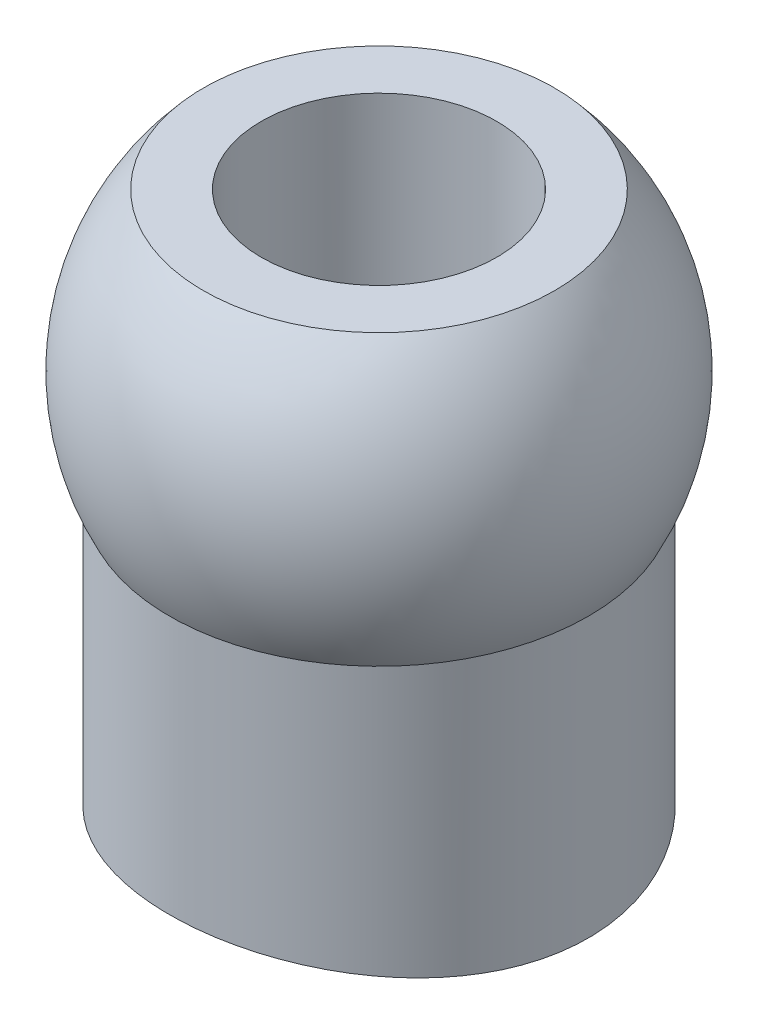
ISO-10303-21;
HEADER;
FILE_DESCRIPTION(('STEP AP214'),'2;1');
FILE_NAME('part.step','',(''),(''),'','','');
FILE_SCHEMA(('AUTOMOTIVE_DESIGN { 1 0 10303 214 1 1 1 1 }'));
ENDSEC;
DATA;
#1=APPLICATION_CONTEXT('core data for automotive mechanical design processes');
#2=APPLICATION_PROTOCOL_DEFINITION('international standard','automotive_design',2000,#1);
#3=PRODUCT_CONTEXT('',#1,'mechanical');
#4=PRODUCT('Part','Part','',(#3));
#5=PRODUCT_RELATED_PRODUCT_CATEGORY('part','',(#4));
#6=PRODUCT_DEFINITION_FORMATION('','',#4);
#7=PRODUCT_DEFINITION_CONTEXT('part definition',#1,'design');
#8=PRODUCT_DEFINITION('design','',#6,#7);
#9=PRODUCT_DEFINITION_SHAPE('','',#8);
#10=(LENGTH_UNIT() NAMED_UNIT(*) SI_UNIT(.MILLI.,.METRE.));
#11=(NAMED_UNIT(*) PLANE_ANGLE_UNIT() SI_UNIT($,.RADIAN.));
#12=(NAMED_UNIT(*) SI_UNIT($,.STERADIAN.) SOLID_ANGLE_UNIT());
#13=UNCERTAINTY_MEASURE_WITH_UNIT(LENGTH_MEASURE(1.E-05),#10,'distance_accuracy_value','');
#14=(GEOMETRIC_REPRESENTATION_CONTEXT(3) GLOBAL_UNCERTAINTY_ASSIGNED_CONTEXT((#13)) GLOBAL_UNIT_ASSIGNED_CONTEXT((#10,
#11,#12)) REPRESENTATION_CONTEXT('',''));
#15=CARTESIAN_POINT('',(0.,0.,0.));
#16=DIRECTION('',(0.,0.,1.));
#17=DIRECTION('',(1.,0.,0.));
#18=AXIS2_PLACEMENT_3D('',#15,#16,#17);
#19=CARTESIAN_POINT('',(0.,0.,0.));
#20=DIRECTION('',(0.,1.,0.));
#21=DIRECTION('',(1.,0.,0.));
#22=AXIS2_PLACEMENT_3D('',#19,#20,#21);
#23=SPHERICAL_SURFACE('',#22,4.5);
#24=CARTESIAN_POINT('',(0.,3.,0.));
#25=DIRECTION('',(0.,1.,0.));
#26=DIRECTION('',(-1.,0.,0.));
#27=AXIS2_PLACEMENT_3D('',#24,#25,#26);
#28=CIRCLE('',#27,3.35410196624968);
#29=CARTESIAN_POINT('',(3.35410196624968,3.,0.));
#30=VERTEX_POINT('',#29);
#31=EDGE_CURVE('E39',#30,#30,#28,.T.);
#32=CARTESIAN_POINT('',(0.,-2.06155281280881,0.));
#33=DIRECTION('',(0.,1.,0.));
#34=DIRECTION('',(-1.,0.,0.));
#35=AXIS2_PLACEMENT_3D('',#32,#33,#34);
#36=CIRCLE('',#35,4.);
#37=CARTESIAN_POINT('',(4.00000000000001,-2.06155281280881,0.));
#38=VERTEX_POINT('',#37);
#39=EDGE_CURVE('E43',#38,#38,#36,.T.);
#40=CARTESIAN_POINT('',(3.35410196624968,3.,0.));
#41=CARTESIAN_POINT('',(3.39177769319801,2.95787807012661,0.));
#42=CARTESIAN_POINT('',(3.42865911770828,2.91504574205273,0.));
#43=CARTESIAN_POINT('',(3.50078285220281,2.82802260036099,0.));
#44=CARTESIAN_POINT('',(3.53602516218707,2.78383178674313,0.));
#45=CARTESIAN_POINT('',(3.60482015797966,2.69415398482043,0.));
#46=CARTESIAN_POINT('',(3.638372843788,2.6486669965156,0.));
#47=CARTESIAN_POINT('',(3.70374110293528,2.55646151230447,0.));
#48=CARTESIAN_POINT('',(3.73555667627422,2.50974301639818,0.));
#49=CARTESIAN_POINT('',(3.79740552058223,2.41514079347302,0.));
#50=CARTESIAN_POINT('',(3.8274387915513,2.36725706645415,0.));
#51=CARTESIAN_POINT('',(3.88568041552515,2.27039234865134,0.));
#52=CARTESIAN_POINT('',(3.91388876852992,2.22141135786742,0.));
#53=CARTESIAN_POINT('',(3.96844051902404,2.12242162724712,0.));
#54=CARTESIAN_POINT('',(3.99478391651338,2.07241288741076,0.));
#55=CARTESIAN_POINT('',(4.0455683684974,1.97143863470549,0.));
#56=CARTESIAN_POINT('',(4.07000942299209,1.92047312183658,0.));
#57=CARTESIAN_POINT('',(4.11695450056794,1.81765765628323,0.));
#58=CARTESIAN_POINT('',(4.13945852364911,1.7658077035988,0.));
#59=CARTESIAN_POINT('',(4.18249759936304,1.66129694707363,0.));
#60=CARTESIAN_POINT('',(4.20303265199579,1.6086361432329,0.));
#61=CARTESIAN_POINT('',(4.24210464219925,1.50257842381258,0.));
#62=CARTESIAN_POINT('',(4.26064157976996,1.449181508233,0.));
#63=CARTESIAN_POINT('',(4.29569103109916,1.34172734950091,0.));
#64=CARTESIAN_POINT('',(4.31220354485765,1.2876701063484,0.));
#65=CARTESIAN_POINT('',(4.3431807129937,1.17897201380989,0.));
#66=CARTESIAN_POINT('',(4.35764536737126,1.12433116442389,0.));
#67=CARTESIAN_POINT('',(4.38450628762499,1.01454340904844,0.));
#68=CARTESIAN_POINT('',(4.39690255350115,0.959396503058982,0.));
#69=CARTESIAN_POINT('',(4.41960910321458,0.84867490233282,0.));
#70=CARTESIAN_POINT('',(4.42991938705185,0.793100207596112,0.));
#71=CARTESIAN_POINT('',(4.44843933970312,0.681601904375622,0.));
#72=CARTESIAN_POINT('',(4.45664900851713,0.62567829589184,0.));
#73=CARTESIAN_POINT('',(4.47095607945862,0.513561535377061,0.));
#74=CARTESIAN_POINT('',(4.4770534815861,0.457368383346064,0.));
#75=CARTESIAN_POINT('',(4.48712736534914,0.344792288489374,0.));
#76=CARTESIAN_POINT('',(4.49110384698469,0.288409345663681,0.));
#77=CARTESIAN_POINT('',(4.49693024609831,0.175533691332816,0.));
#78=CARTESIAN_POINT('',(4.49878016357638,0.119040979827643,0.));
#79=CARTESIAN_POINT('',(4.50035080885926,0.00602596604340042,0.));
#80=CARTESIAN_POINT('',(4.50007153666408,-0.0504963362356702,0.));
#81=CARTESIAN_POINT('',(4.49738419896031,-0.163490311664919,0.));
#82=CARTESIAN_POINT('',(4.49497613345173,-0.219961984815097,0.));
#83=CARTESIAN_POINT('',(4.48803462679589,-0.332774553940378,0.));
#84=CARTESIAN_POINT('',(4.48350118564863,-0.389115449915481,0.));
#85=CARTESIAN_POINT('',(4.47231536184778,-0.501586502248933,0.));
#86=CARTESIAN_POINT('',(4.4656629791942,-0.557716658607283,0.));
#87=CARTESIAN_POINT('',(4.45024871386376,-0.669686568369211,0.));
#88=CARTESIAN_POINT('',(4.44148683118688,-0.72552632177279,0.));
#89=CARTESIAN_POINT('',(4.42186600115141,-0.836836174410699,0.));
#90=CARTESIAN_POINT('',(4.41100705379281,-0.892306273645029,0.));
#91=CARTESIAN_POINT('',(4.38720750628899,-1.00279809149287,0.));
#92=CARTESIAN_POINT('',(4.37426690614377,-1.05781981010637,0.));
#93=CARTESIAN_POINT('',(4.34632241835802,-1.16733677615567,0.));
#94=CARTESIAN_POINT('',(4.33131853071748,-1.22183202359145,0.));
#95=CARTESIAN_POINT('',(4.29926876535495,-1.33021870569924,0.));
#96=CARTESIAN_POINT('',(4.28222288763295,-1.38411014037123,0.));
#97=CARTESIAN_POINT('',(4.24611332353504,-1.49121270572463,0.));
#98=CARTESIAN_POINT('',(4.22704963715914,-1.54442383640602,0.));
#99=CARTESIAN_POINT('',(4.18693155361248,-1.65009029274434,0.));
#100=CARTESIAN_POINT('',(4.16587715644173,-1.70254561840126,0.));
#101=CARTESIAN_POINT('',(4.12180737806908,-1.80662594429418,0.));
#102=CARTESIAN_POINT('',(4.09879199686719,-1.85825094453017,0.));
#103=CARTESIAN_POINT('',(4.05083349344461,-1.96059762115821,0.));
#104=CARTESIAN_POINT('',(4.02589037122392,-2.01131929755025,0.));
#105=CARTESIAN_POINT('',(4.00000000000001,-2.06155281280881,0.));
#106=B_SPLINE_CURVE_WITH_KNOTS('',3,(#40,#41,#42,#43,#44,#45,#46,#47,#48,#49,#50,#51,#52,#53,
#54,#55,#56,#57,#58,#59,#60,#61,#62,#63,#64,#65,#66,#67,#68,#69,#70,#71,#72,#73,#74,#75,#76,#77,
#78,#79,#80,#81,#82,#83,#84,#85,#86,#87,#88,#89,#90,#91,#92,#93,#94,#95,#96,#97,#98,#99,#100,
#101,#102,#103,#104,#105),.UNSPECIFIED.,.F.,.F.,(4,2,2,2,2,2,2,2,2,2,2,2,2,2,2,2,2,2,2,2,2,2,2,
2,2,2,2,2,2,2,2,2,4),(0.,0.169528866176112,0.339057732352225,0.508586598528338,0.67811546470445,
0.847644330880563,1.01717319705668,1.18670206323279,1.3562309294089,1.52575979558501,
1.69528866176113,1.86481752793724,2.03434639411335,2.20387526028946,2.37340412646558,
2.54293299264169,2.7124618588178,2.88199072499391,3.05151959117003,3.22104845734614,
3.39057732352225,3.56010618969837,3.72963505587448,3.89916392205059,4.0686927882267,
4.23822165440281,4.40775052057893,4.57727938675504,4.74680825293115,4.91633711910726,
5.08586598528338,5.25539485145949,5.4249237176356),.UNSPECIFIED.);
#107=EDGE_CURVE('BSEAM28',#30,#38,#106,.T.);
#108=ORIENTED_EDGE('',*,*,#31,.F.);
#109=ORIENTED_EDGE('',*,*,#39,.T.);
#110=ORIENTED_EDGE('',*,*,#107,.T.);
#111=ORIENTED_EDGE('',*,*,#107,.F.);
#112=EDGE_LOOP('',(#108,#110,#109,#111));
#113=FACE_BOUND('',#112,.T.);
#114=ADVANCED_FACE('F28',(#113),#23,.T.);
#115=CARTESIAN_POINT('',(0.,3.,0.));
#116=DIRECTION('',(0.,-1.,0.));
#117=DIRECTION('',(1.,0.,0.));
#118=AXIS2_PLACEMENT_3D('',#115,#116,#117);
#119=PLANE('',#118);
#120=CARTESIAN_POINT('',(0.,3.,0.));
#121=DIRECTION('',(0.,1.,0.));
#122=DIRECTION('',(0.,0.,1.));
#123=AXIS2_PLACEMENT_3D('',#120,#121,#122);
#124=CIRCLE('',#123,2.24999999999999);
#125=CARTESIAN_POINT('',(0.,3.,2.24999999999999));
#126=VERTEX_POINT('',#125);
#127=EDGE_CURVE('E77',#126,#126,#124,.T.);
#128=ORIENTED_EDGE('',*,*,#127,.F.);
#129=EDGE_LOOP('',(#128));
#130=FACE_BOUND('',#129,.T.);
#131=ORIENTED_EDGE('',*,*,#31,.T.);
#132=EDGE_LOOP('',(#131));
#133=FACE_BOUND('',#132,.T.);
#134=ADVANCED_FACE('F65',(#130,#133),#119,.F.);
#135=CARTESIAN_POINT('',(0.,52.8708930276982,0.));
#136=DIRECTION('',(0.,1.,0.));
#137=DIRECTION('',(-1.,0.,0.));
#138=AXIS2_PLACEMENT_3D('',#135,#136,#137);
#139=CYLINDRICAL_SURFACE('',#138,4.);
#140=ORIENTED_EDGE('',*,*,#39,.F.);
#141=EDGE_LOOP('',(#140));
#142=FACE_BOUND('',#141,.T.);
#143=CARTESIAN_POINT('',(-3.99999999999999,-7.38447187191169,0.));
#144=CARTESIAN_POINT('',(-3.99999153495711,-7.38446753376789,0.222484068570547));
#145=CARTESIAN_POINT('',(-3.98137482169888,-7.38083115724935,0.445077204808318));
#146=CARTESIAN_POINT('',(-3.90745280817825,-7.36669741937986,0.883982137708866));
#147=CARTESIAN_POINT('',(-3.85211679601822,-7.35619431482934,1.10028851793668));
#148=CARTESIAN_POINT('',(-3.70652120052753,-7.32955884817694,1.52020603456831));
#149=CARTESIAN_POINT('',(-3.61629466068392,-7.31343181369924,1.72382897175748));
#150=CARTESIAN_POINT('',(-3.40356743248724,-7.27737191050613,2.11303644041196));
#151=CARTESIAN_POINT('',(-3.28106909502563,-7.2574393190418,2.29862228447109));
#152=CARTESIAN_POINT('',(-3.00559908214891,-7.21572833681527,2.64888311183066));
#153=CARTESIAN_POINT('',(-2.85229293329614,-7.19393134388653,2.81329286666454));
#154=CARTESIAN_POINT('',(-2.5202819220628,-7.15111169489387,3.11422258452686));
#155=CARTESIAN_POINT('',(-2.34157536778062,-7.13008909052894,3.25074068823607));
#156=CARTESIAN_POINT('',(-1.96209093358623,-7.09098730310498,3.49303120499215));
#157=CARTESIAN_POINT('',(-1.76115035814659,-7.07293259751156,3.59855308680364));
#158=CARTESIAN_POINT('',(-1.3439914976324,-7.04200927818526,3.77424109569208));
#159=CARTESIAN_POINT('',(-1.12777451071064,-7.02914022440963,3.84441022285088));
#160=CARTESIAN_POINT('',(-0.688949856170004,-7.01016959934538,3.94657944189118));
#161=CARTESIAN_POINT('',(-0.466449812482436,-7.00398878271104,3.97902682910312));
#162=CARTESIAN_POINT('',(-0.0190839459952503,-6.99881777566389,4.00622563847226));
#163=CARTESIAN_POINT('',(0.205781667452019,-6.99982695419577,4.00098036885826));
#164=CARTESIAN_POINT('',(0.648426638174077,-7.00886042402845,3.95328492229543));
#165=CARTESIAN_POINT('',(0.866260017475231,-7.01679389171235,3.91131641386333));
#166=CARTESIAN_POINT('',(1.29173491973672,-7.03868253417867,3.79212813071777));
#167=CARTESIAN_POINT('',(1.49937606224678,-7.05263793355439,3.71490704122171));
#168=CARTESIAN_POINT('',(1.89996408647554,-7.08515371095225,3.5269496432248));
#169=CARTESIAN_POINT('',(2.09281882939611,-7.10374030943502,3.41602168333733));
#170=CARTESIAN_POINT('',(2.45735639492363,-7.14346450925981,3.16394073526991));
#171=CARTESIAN_POINT('',(2.62903699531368,-7.16460237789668,3.02278457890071));
#172=CARTESIAN_POINT('',(2.9492078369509,-7.20748399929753,2.71160263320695));
#173=CARTESIAN_POINT('',(3.09728818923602,-7.22923204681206,2.54115541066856));
#174=CARTESIAN_POINT('',(3.36282428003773,-7.27056377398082,2.17763117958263));
#175=CARTESIAN_POINT('',(3.48027954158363,-7.29014741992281,1.98455381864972));
#176=CARTESIAN_POINT('',(3.68135386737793,-7.32493978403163,1.5806961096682));
#177=CARTESIAN_POINT('',(3.76491178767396,-7.34014058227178,1.36988459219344));
#178=CARTESIAN_POINT('',(3.89530564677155,-7.36432613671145,0.936859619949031));
#179=CARTESIAN_POINT('',(3.94214589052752,-7.37331162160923,0.714647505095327));
#180=CARTESIAN_POINT('',(3.99717303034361,-7.3839045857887,0.268829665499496));
#181=CARTESIAN_POINT('',(4.0059495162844,-7.38562459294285,0.0452993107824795));
#182=CARTESIAN_POINT('',(3.98618188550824,-7.38179319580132,-0.400032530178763));
#183=CARTESIAN_POINT('',(3.95763967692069,-7.37624216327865,-0.621834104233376));
#184=CARTESIAN_POINT('',(3.86455151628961,-7.35859909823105,-1.05546384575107));
#185=CARTESIAN_POINT('',(3.80031602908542,-7.34656349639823,-1.2673611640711));
#186=CARTESIAN_POINT('',(3.63799472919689,-7.31735622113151,-1.67738552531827));
#187=CARTESIAN_POINT('',(3.53990635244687,-7.30018415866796,-1.8755115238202));
#188=CARTESIAN_POINT('',(3.31131186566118,-7.26238337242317,-2.25496251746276));
#189=CARTESIAN_POINT('',(3.18043412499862,-7.24171597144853,-2.436059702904));
#190=CARTESIAN_POINT('',(2.89047583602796,-7.19936137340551,-2.77393571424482));
#191=CARTESIAN_POINT('',(2.73139266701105,-7.17767408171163,-2.93071227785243));
#192=CARTESIAN_POINT('',(2.38690287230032,-7.1353608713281,-3.21770703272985));
#193=CARTESIAN_POINT('',(2.20116281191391,-7.11475376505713,-3.34752820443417));
#194=CARTESIAN_POINT('',(1.81016635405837,-7.07724175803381,-3.57412176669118));
#195=CARTESIAN_POINT('',(1.60491072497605,-7.06033671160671,-3.67089545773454));
#196=CARTESIAN_POINT('',(1.18179412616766,-7.03221433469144,-3.82805630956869));
#197=CARTESIAN_POINT('',(0.964006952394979,-7.02096687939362,-3.88863652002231));
#198=CARTESIAN_POINT('',(0.521114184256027,-7.00529829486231,-3.9723058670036));
#199=CARTESIAN_POINT('',(0.296009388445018,-7.00087642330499,-3.99539908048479));
#200=CARTESIAN_POINT('',(-0.151324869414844,-6.99937264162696,-4.00329324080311));
#201=CARTESIAN_POINT('',(-0.373543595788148,-7.00217591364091,-3.98869318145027));
#202=CARTESIAN_POINT('',(-0.812299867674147,-7.01456819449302,-3.92292961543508));
#203=CARTESIAN_POINT('',(-1.02883747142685,-7.02415713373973,-3.87176648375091));
#204=CARTESIAN_POINT('',(-1.4497549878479,-7.04904261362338,-3.73458478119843));
#205=CARTESIAN_POINT('',(-1.65415698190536,-7.06432839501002,-3.64863188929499));
#206=CARTESIAN_POINT('',(-2.04572631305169,-7.09895491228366,-3.44438323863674));
#207=CARTESIAN_POINT('',(-2.23289244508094,-7.11829593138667,-3.32608522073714));
#208=CARTESIAN_POINT('',(-2.58765662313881,-7.15926029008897,-3.05845213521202));
#209=CARTESIAN_POINT('',(-2.75492557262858,-7.18091306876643,-2.90868528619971));
#210=CARTESIAN_POINT('',(-3.06216464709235,-7.22387733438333,-2.5832598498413));
#211=CARTESIAN_POINT('',(-3.202128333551,-7.24518873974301,-2.40759517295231));
#212=CARTESIAN_POINT('',(-3.45204959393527,-7.2852812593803,-2.03334176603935));
#213=CARTESIAN_POINT('',(-3.56170623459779,-7.30403612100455,-1.83454916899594));
#214=CARTESIAN_POINT('',(-3.74588992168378,-7.3365751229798,-1.42106729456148));
#215=CARTESIAN_POINT('',(-3.82044982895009,-7.3503639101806,-1.20639310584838));
#216=CARTESIAN_POINT('',(-3.91733139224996,-7.368562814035,-0.825932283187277));
#217=CARTESIAN_POINT('',(-3.94827845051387,-7.37449292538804,-0.662360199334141));
#218=CARTESIAN_POINT('',(-3.98961562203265,-7.38244901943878,-0.332545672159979));
#219=CARTESIAN_POINT('',(-4.00000632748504,-7.38447511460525,-0.16630330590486));
#220=CARTESIAN_POINT('',(-3.99999999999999,-7.38447187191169,0.));
#221=B_SPLINE_CURVE_WITH_KNOTS('',3,(#143,#144,#145,#146,#147,#148,#149,#150,#151,#152,#153,
#154,#155,#156,#157,#158,#159,#160,#161,#162,#163,#164,#165,#166,#167,#168,#169,#170,#171,#172,
#173,#174,#175,#176,#177,#178,#179,#180,#181,#182,#183,#184,#185,#186,#187,#188,#189,#190,#191,
#192,#193,#194,#195,#196,#197,#198,#199,#200,#201,#202,#203,#204,#205,#206,#207,#208,#209,#210,
#211,#212,#213,#214,#215,#216,#217,#218,#219,#220),.UNSPECIFIED.,.T.,.F.,(4,2,2,2,2,2,2,2,2,2,2,
2,2,2,2,2,2,2,2,2,2,2,2,2,2,2,2,2,2,2,2,2,2,2,2,2,2,2,4),(0.,0.666843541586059,1.33424553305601,
2.00101699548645,2.66773989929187,3.34213567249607,4.01657638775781,4.69632714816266,
5.3760202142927,6.047568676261,6.71905819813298,7.38187017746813,8.04470687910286,
8.71138520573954,9.37813344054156,10.0554308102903,10.7327387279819,11.4112629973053,
12.0897077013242,12.7576052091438,13.4254685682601,14.0876116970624,14.7498049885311,
15.4198728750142,16.090003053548,16.769395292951,17.4487607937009,18.1244695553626,
18.8001048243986,19.4650697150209,20.1300277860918,20.7937363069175,21.457491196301,
22.1310297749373,22.8047269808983,23.4848911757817,24.1644172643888,24.6628865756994,
25.161341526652),.UNSPECIFIED.);
#222=CARTESIAN_POINT('',(-3.99999999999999,-7.38447187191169,0.));
#223=VERTEX_POINT('',#222);
#224=EDGE_CURVE('E10',#223,#223,#221,.T.);
#225=ORIENTED_EDGE('',*,*,#224,.T.);
#226=EDGE_LOOP('',(#225));
#227=FACE_BOUND('',#226,.T.);
#228=ADVANCED_FACE('F49',(#142,#227),#139,.T.);
#229=CARTESIAN_POINT('',(0.,-28.,-4.5));
#230=DIRECTION('',(0.,0.,1.));
#231=DIRECTION('',(1.,0.,0.));
#232=AXIS2_PLACEMENT_3D('',#229,#230,#231);
#233=CYLINDRICAL_SURFACE('',#232,21.);
#234=CARTESIAN_POINT('',(0.,-7.,2.24999999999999));
#235=CARTESIAN_POINT('',(0.12599605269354,-7.00000154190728,2.24999456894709));
#236=CARTESIAN_POINT('',(0.252074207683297,-7.00114595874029,2.23938101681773));
#237=CARTESIAN_POINT('',(0.500731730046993,-7.0056012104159,2.19720362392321));
#238=CARTESIAN_POINT('',(0.623307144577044,-7.0089143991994,2.16561701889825));
#239=CARTESIAN_POINT('',(0.861322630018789,-7.01733339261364,2.08242658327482));
#240=CARTESIAN_POINT('',(0.97676708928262,-7.02243808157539,2.03083520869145));
#241=CARTESIAN_POINT('',(1.19733399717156,-7.03387008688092,1.90912474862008));
#242=CARTESIAN_POINT('',(1.30245841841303,-7.04019716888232,1.83900921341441));
#243=CARTESIAN_POINT('',(1.49985670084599,-7.05339484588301,1.68193244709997));
#244=CARTESIAN_POINT('',(1.59208222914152,-7.06026734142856,1.59491062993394));
#245=CARTESIAN_POINT('',(1.76064911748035,-7.07376566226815,1.4066210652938));
#246=CARTESIAN_POINT('',(1.83698972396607,-7.08039147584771,1.30535264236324));
#247=CARTESIAN_POINT('',(1.97179354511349,-7.09266541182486,1.09113856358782));
#248=CARTESIAN_POINT('',(2.03021257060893,-7.09831110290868,0.978164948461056));
#249=CARTESIAN_POINT('',(2.12723276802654,-7.10796151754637,0.743940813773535));
#250=CARTESIAN_POINT('',(2.1658344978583,-7.11196628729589,0.622690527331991));
#251=CARTESIAN_POINT('',(2.22197998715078,-7.11786392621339,0.375850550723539));
#252=CARTESIAN_POINT('',(2.23960435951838,-7.11976487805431,0.250279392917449));
#253=CARTESIAN_POINT('',(2.25354410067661,-7.12126462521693,-0.00205184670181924));
#254=CARTESIAN_POINT('',(2.24986010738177,-7.12086348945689,-0.128811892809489));
#255=CARTESIAN_POINT('',(2.22135406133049,-7.11781177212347,-0.379365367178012));
#256=CARTESIAN_POINT('',(2.19662023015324,-7.11517057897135,-0.503168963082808));
#257=CARTESIAN_POINT('',(2.12685398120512,-7.10795099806,-0.744857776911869));
#258=CARTESIAN_POINT('',(2.08182125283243,-7.10337258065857,-0.862742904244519));
#259=CARTESIAN_POINT('',(1.97263881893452,-7.09278365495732,-1.08952592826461));
#260=CARTESIAN_POINT('',(1.90845018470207,-7.08677023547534,-1.19840494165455));
#261=CARTESIAN_POINT('',(1.76280595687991,-7.07399126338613,-1.40387835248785));
#262=CARTESIAN_POINT('',(1.68134978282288,-7.06722568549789,-1.50047233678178));
#263=CARTESIAN_POINT('',(1.50299098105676,-7.05366288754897,-1.679146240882));
#264=CARTESIAN_POINT('',(1.40601220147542,-7.04686568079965,-1.76115016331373));
#265=CARTESIAN_POINT('',(1.19962489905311,-7.03403777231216,-1.90772640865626));
#266=CARTESIAN_POINT('',(1.09021635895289,-7.02800707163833,-1.9722987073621));
#267=CARTESIAN_POINT('',(0.862021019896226,-7.01738925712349,-2.08217650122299));
#268=CARTESIAN_POINT('',(0.743232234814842,-7.0128024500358,-2.12747790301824));
#269=CARTESIAN_POINT('',(0.499674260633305,-7.00559225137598,-2.19747104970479));
#270=CARTESIAN_POINT('',(0.374905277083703,-7.00296879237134,-2.2221635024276));
#271=CARTESIAN_POINT('',(0.12358650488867,-6.99998956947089,-2.25014086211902));
#272=CARTESIAN_POINT('',(-0.00295148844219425,-6.99962270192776,-2.25353059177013));
#273=CARTESIAN_POINT('',(-0.254793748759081,-7.00116816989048,-2.2390819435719));
#274=CARTESIAN_POINT('',(-0.380098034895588,-7.00308046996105,-2.22124389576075));
#275=CARTESIAN_POINT('',(-0.625611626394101,-7.00896235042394,-2.16493304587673));
#276=CARTESIAN_POINT('',(-0.745832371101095,-7.01292701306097,-2.12650956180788));
#277=CARTESIAN_POINT('',(-0.97812243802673,-7.02246909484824,-2.0301693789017));
#278=CARTESIAN_POINT('',(-1.09019155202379,-7.02804655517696,-1.97225218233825));
#279=CARTESIAN_POINT('',(-1.30346954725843,-7.04021860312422,-1.83831034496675));
#280=CARTESIAN_POINT('',(-1.40463513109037,-7.04681700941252,-1.76221711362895));
#281=CARTESIAN_POINT('',(-1.59279548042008,-7.06027894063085,-1.59418121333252));
#282=CARTESIAN_POINT('',(-1.67978983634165,-7.06714247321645,-1.50223808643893));
#283=CARTESIAN_POINT('',(-1.83750434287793,-7.0803947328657,-1.30465377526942));
#284=CARTESIAN_POINT('',(-1.90815551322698,-7.08678137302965,-1.19895737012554));
#285=CARTESIAN_POINT('',(-2.03070330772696,-7.09832425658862,-0.977138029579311));
#286=CARTESIAN_POINT('',(-2.08260022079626,-7.10348051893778,-0.861015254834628));
#287=CARTESIAN_POINT('',(-2.16605185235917,-7.11196545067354,-0.621872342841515));
#288=CARTESIAN_POINT('',(-2.19764704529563,-7.11529775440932,-0.498866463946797));
#289=CARTESIAN_POINT('',(-2.23972944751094,-7.11976851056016,-0.249257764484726));
#290=CARTESIAN_POINT('',(-2.25021736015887,-7.1209070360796,-0.122655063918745));
#291=CARTESIAN_POINT('',(-2.24977690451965,-7.12085962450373,0.129867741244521));
#292=CARTESIAN_POINT('',(-2.23895689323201,-7.11968544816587,0.255788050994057));
#293=CARTESIAN_POINT('',(-2.19643552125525,-7.11517006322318,0.504010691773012));
#294=CARTESIAN_POINT('',(-2.164734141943,-7.11182885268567,0.626313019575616));
#295=CARTESIAN_POINT('',(-2.08138090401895,-7.10335922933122,0.863823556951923));
#296=CARTESIAN_POINT('',(-2.02973277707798,-7.09823115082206,0.97903308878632));
#297=CARTESIAN_POINT('',(-1.90796310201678,-7.08676494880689,1.19916597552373));
#298=CARTESIAN_POINT('',(-1.83784156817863,-7.08042682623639,1.30408933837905));
#299=CARTESIAN_POINT('',(-1.68070964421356,-7.06721604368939,1.5012266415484));
#300=CARTESIAN_POINT('',(-1.59361844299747,-7.06034092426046,1.59337600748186));
#301=CARTESIAN_POINT('',(-1.40518265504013,-7.04685310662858,1.76179790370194));
#302=CARTESIAN_POINT('',(-1.30383467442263,-7.04024047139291,1.83806664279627));
#303=CARTESIAN_POINT('',(-1.08944143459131,-7.02800271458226,1.97273768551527));
#304=CARTESIAN_POINT('',(-0.976363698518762,-7.02238045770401,2.03108851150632));
#305=CARTESIAN_POINT('',(-0.742024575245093,-7.01278733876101,2.12789475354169));
#306=CARTESIAN_POINT('',(-0.62077249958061,-7.00881463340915,2.16637238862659));
#307=CARTESIAN_POINT('',(-0.415707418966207,-7.00395585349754,2.21284591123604));
#308=CARTESIAN_POINT('',(-0.33320097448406,-7.00247940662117,2.22675940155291));
#309=CARTESIAN_POINT('',(-0.167141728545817,-7.00050097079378,2.24533822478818));
#310=CARTESIAN_POINT('',(-0.0835889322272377,-6.99999897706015,2.25000360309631));
#311=CARTESIAN_POINT('',(0.,-7.,2.24999999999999));
#312=B_SPLINE_CURVE_WITH_KNOTS('',3,(#234,#235,#236,#237,#238,#239,#240,#241,#242,#243,#244,
#245,#246,#247,#248,#249,#250,#251,#252,#253,#254,#255,#256,#257,#258,#259,#260,#261,#262,#263,
#264,#265,#266,#267,#268,#269,#270,#271,#272,#273,#274,#275,#276,#277,#278,#279,#280,#281,#282,
#283,#284,#285,#286,#287,#288,#289,#290,#291,#292,#293,#294,#295,#296,#297,#298,#299,#300,#301,
#302,#303,#304,#305,#306,#307,#308,#309,#310,#311),.UNSPECIFIED.,.T.,.F.,(4,2,2,2,2,2,2,2,2,2,2,
2,2,2,2,2,2,2,2,2,2,2,2,2,2,2,2,2,2,2,2,2,2,2,2,2,2,2,4),(0.,0.377682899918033,0.75577641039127,
1.13363487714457,1.51142097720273,1.89058676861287,2.2697705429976,2.6498818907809,
3.02998253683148,3.40861774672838,3.78724162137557,4.16428642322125,4.5413369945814,
4.91915908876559,5.29699388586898,5.67674255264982,6.05649174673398,6.43632156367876,
6.81613833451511,7.19408469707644,7.5720251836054,7.94906423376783,8.3261129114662,
8.70460757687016,9.08311317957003,9.46318833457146,9.84325763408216,10.2225668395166,
10.6018634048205,10.9792361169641,11.3566091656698,11.7339116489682,12.1112138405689,
12.4903587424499,12.8695940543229,13.2499089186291,13.629797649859,13.88036316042,
14.1309274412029),.UNSPECIFIED.);
#313=CARTESIAN_POINT('',(0.,-7.,2.24999999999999));
#314=VERTEX_POINT('',#313);
#315=EDGE_CURVE('E31',#314,#314,#312,.T.);
#316=ORIENTED_EDGE('',*,*,#315,.T.);
#317=EDGE_LOOP('',(#316));
#318=FACE_BOUND('',#317,.T.);
#319=ORIENTED_EDGE('',*,*,#224,.F.);
#320=EDGE_LOOP('',(#319));
#321=FACE_BOUND('',#320,.T.);
#322=ADVANCED_FACE('F51',(#318,#321),#233,.F.);
#323=CARTESIAN_POINT('',(0.,3.,0.));
#324=DIRECTION('',(0.,1.,0.));
#325=DIRECTION('',(0.,0.,1.));
#326=AXIS2_PLACEMENT_3D('',#323,#324,#325);
#327=CYLINDRICAL_SURFACE('',#326,2.24999999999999);
#328=ORIENTED_EDGE('',*,*,#127,.T.);
#329=EDGE_LOOP('',(#328));
#330=FACE_BOUND('',#329,.T.);
#331=ORIENTED_EDGE('',*,*,#315,.F.);
#332=EDGE_LOOP('',(#331));
#333=FACE_BOUND('',#332,.T.);
#334=ADVANCED_FACE('F54',(#330,#333),#327,.F.);
#335=CLOSED_SHELL('',(#114,#134,#228,#322,#334));
#336=MANIFOLD_SOLID_BREP('B2',#335);
#337=ADVANCED_BREP_SHAPE_REPRESENTATION('',(#18,#336),#14);
#338=SHAPE_DEFINITION_REPRESENTATION(#9,#337);
ENDSEC;
END-ISO-10303-21;
